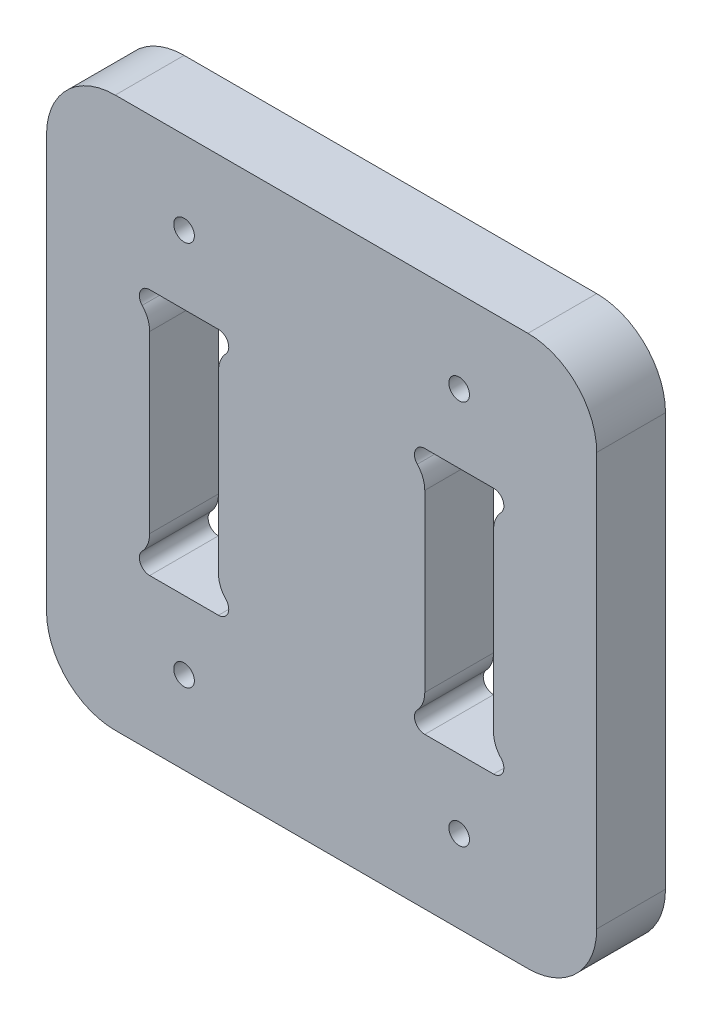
ISO-10303-21;
HEADER;
FILE_DESCRIPTION(('STEP AP214'),'2;1');
FILE_NAME('part.step','',(''),(''),'','','');
FILE_SCHEMA(('AUTOMOTIVE_DESIGN { 1 0 10303 214 1 1 1 1 }'));
ENDSEC;
DATA;
#1=APPLICATION_CONTEXT('core data for automotive mechanical design processes');
#2=APPLICATION_PROTOCOL_DEFINITION('international standard','automotive_design',2000,#1);
#3=PRODUCT_CONTEXT('',#1,'mechanical');
#4=PRODUCT('Part','Part','',(#3));
#5=PRODUCT_RELATED_PRODUCT_CATEGORY('part','',(#4));
#6=PRODUCT_DEFINITION_FORMATION('','',#4);
#7=PRODUCT_DEFINITION_CONTEXT('part definition',#1,'design');
#8=PRODUCT_DEFINITION('design','',#6,#7);
#9=PRODUCT_DEFINITION_SHAPE('','',#8);
#10=(LENGTH_UNIT() NAMED_UNIT(*) SI_UNIT(.MILLI.,.METRE.));
#11=(NAMED_UNIT(*) PLANE_ANGLE_UNIT() SI_UNIT($,.RADIAN.));
#12=(NAMED_UNIT(*) SI_UNIT($,.STERADIAN.) SOLID_ANGLE_UNIT());
#13=UNCERTAINTY_MEASURE_WITH_UNIT(LENGTH_MEASURE(1.E-05),#10,'distance_accuracy_value','');
#14=(GEOMETRIC_REPRESENTATION_CONTEXT(3) GLOBAL_UNCERTAINTY_ASSIGNED_CONTEXT((#13)) GLOBAL_UNIT_ASSIGNED_CONTEXT((#10,
#11,#12)) REPRESENTATION_CONTEXT('',''));
#15=CARTESIAN_POINT('',(0.,0.,0.));
#16=DIRECTION('',(0.,0.,1.));
#17=DIRECTION('',(1.,0.,0.));
#18=AXIS2_PLACEMENT_3D('',#15,#16,#17);
#19=CARTESIAN_POINT('',(30.,-30.,10.));
#20=DIRECTION('',(0.,0.,1.));
#21=DIRECTION('',(1.,0.,0.));
#22=AXIS2_PLACEMENT_3D('',#19,#20,#21);
#23=PLANE('',#22);
#24=CARTESIAN_POINT('',(-20.,28.,10.));
#25=DIRECTION('',(0.,0.,1.));
#26=DIRECTION('',(1.,0.,0.));
#27=AXIS2_PLACEMENT_3D('',#24,#25,#26);
#28=CIRCLE('',#27,1.5);
#29=CARTESIAN_POINT('',(-18.5,28.,10.));
#30=VERTEX_POINT('',#29);
#31=EDGE_CURVE('E315',#30,#30,#28,.T.);
#32=ORIENTED_EDGE('',*,*,#31,.F.);
#33=EDGE_LOOP('',(#32));
#34=FACE_BOUND('',#33,.T.);
#35=CARTESIAN_POINT('',(20.,-28.,10.));
#36=DIRECTION('',(0.,0.,1.));
#37=DIRECTION('',(-1.,0.,0.));
#38=AXIS2_PLACEMENT_3D('',#35,#36,#37);
#39=CIRCLE('',#38,1.5);
#40=CARTESIAN_POINT('',(18.5,-28.,10.));
#41=VERTEX_POINT('',#40);
#42=EDGE_CURVE('E518',#41,#41,#39,.T.);
#43=ORIENTED_EDGE('',*,*,#42,.F.);
#44=EDGE_LOOP('',(#43));
#45=FACE_BOUND('',#44,.T.);
#46=CARTESIAN_POINT('',(30.,-30.,10.));
#47=DIRECTION('',(0.,0.,1.));
#48=DIRECTION('',(1.,0.,0.));
#49=AXIS2_PLACEMENT_3D('',#46,#47,#48);
#50=CIRCLE('',#49,10.);
#51=CARTESIAN_POINT('',(30.,-40.,10.));
#52=VERTEX_POINT('',#51);
#53=CARTESIAN_POINT('',(40.,-30.,10.));
#54=VERTEX_POINT('',#53);
#55=EDGE_CURVE('E526',#52,#54,#50,.T.);
#56=ORIENTED_EDGE('',*,*,#55,.T.);
#57=DIRECTION('',(0.,1.,0.));
#58=VECTOR('',#57,1.);
#59=CARTESIAN_POINT('',(40.,30.,10.));
#60=LINE('',#59,#58);
#61=CARTESIAN_POINT('',(40.,30.,10.));
#62=VERTEX_POINT('',#61);
#63=EDGE_CURVE('E530',#54,#62,#60,.T.);
#64=ORIENTED_EDGE('',*,*,#63,.T.);
#65=CARTESIAN_POINT('',(30.,30.,10.));
#66=DIRECTION('',(0.,0.,1.));
#67=DIRECTION('',(-1.,0.,0.));
#68=AXIS2_PLACEMENT_3D('',#65,#66,#67);
#69=CIRCLE('',#68,10.);
#70=CARTESIAN_POINT('',(30.,40.,10.));
#71=VERTEX_POINT('',#70);
#72=EDGE_CURVE('E534',#62,#71,#69,.T.);
#73=ORIENTED_EDGE('',*,*,#72,.T.);
#74=DIRECTION('',(-1.,0.,0.));
#75=VECTOR('',#74,1.);
#76=CARTESIAN_POINT('',(-30.,40.,10.));
#77=LINE('',#76,#75);
#78=CARTESIAN_POINT('',(-30.,40.,10.));
#79=VERTEX_POINT('',#78);
#80=EDGE_CURVE('E537',#71,#79,#77,.T.);
#81=ORIENTED_EDGE('',*,*,#80,.T.);
#82=CARTESIAN_POINT('',(-30.,30.,10.));
#83=DIRECTION('',(0.,0.,1.));
#84=DIRECTION('',(1.,0.,0.));
#85=AXIS2_PLACEMENT_3D('',#82,#83,#84);
#86=CIRCLE('',#85,10.);
#87=CARTESIAN_POINT('',(-40.,30.,10.));
#88=VERTEX_POINT('',#87);
#89=EDGE_CURVE('E540',#79,#88,#86,.T.);
#90=ORIENTED_EDGE('',*,*,#89,.T.);
#91=DIRECTION('',(0.,-1.,0.));
#92=VECTOR('',#91,1.);
#93=CARTESIAN_POINT('',(-40.,30.,10.));
#94=LINE('',#93,#92);
#95=CARTESIAN_POINT('',(-40.,-30.,10.));
#96=VERTEX_POINT('',#95);
#97=EDGE_CURVE('E543',#88,#96,#94,.T.);
#98=ORIENTED_EDGE('',*,*,#97,.T.);
#99=CARTESIAN_POINT('',(-30.,-30.,10.));
#100=DIRECTION('',(0.,0.,1.));
#101=DIRECTION('',(1.,0.,0.));
#102=AXIS2_PLACEMENT_3D('',#99,#100,#101);
#103=CIRCLE('',#102,10.);
#104=CARTESIAN_POINT('',(-30.,-40.,10.));
#105=VERTEX_POINT('',#104);
#106=EDGE_CURVE('E546',#96,#105,#103,.T.);
#107=ORIENTED_EDGE('',*,*,#106,.T.);
#108=DIRECTION('',(1.,0.,0.));
#109=VECTOR('',#108,1.);
#110=CARTESIAN_POINT('',(-30.,-40.,10.));
#111=LINE('',#110,#109);
#112=EDGE_CURVE('E549',#105,#52,#111,.T.);
#113=ORIENTED_EDGE('',*,*,#112,.T.);
#114=EDGE_LOOP('',(#56,#64,#73,#81,#90,#98,#107,#113));
#115=FACE_BOUND('',#114,.T.);
#116=CARTESIAN_POINT('',(20.,28.,10.));
#117=DIRECTION('',(0.,0.,1.));
#118=DIRECTION('',(-1.,0.,0.));
#119=AXIS2_PLACEMENT_3D('',#116,#117,#118);
#120=CIRCLE('',#119,1.5);
#121=CARTESIAN_POINT('',(18.5,28.,10.));
#122=VERTEX_POINT('',#121);
#123=EDGE_CURVE('E510',#122,#122,#120,.T.);
#124=ORIENTED_EDGE('',*,*,#123,.F.);
#125=EDGE_LOOP('',(#124));
#126=FACE_BOUND('',#125,.T.);
#127=CARTESIAN_POINT('',(11.,12.7250827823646,10.));
#128=DIRECTION('',(0.,0.,-1.));
#129=DIRECTION('',(-1.,0.,0.));
#130=AXIS2_PLACEMENT_3D('',#127,#128,#129);
#131=CIRCLE('',#130,4.);
#132=CARTESIAN_POINT('',(13.9090909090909,15.4704771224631,10.));
#133=VERTEX_POINT('',#132);
#134=CARTESIAN_POINT('',(15.,12.7250827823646,10.));
#135=VERTEX_POINT('',#134);
#136=EDGE_CURVE('E390',#133,#135,#131,.T.);
#137=ORIENTED_EDGE('',*,*,#136,.F.);
#138=CARTESIAN_POINT('',(15.,16.5,10.));
#139=DIRECTION('',(0.,0.,1.));
#140=DIRECTION('',(-1.,0.,0.));
#141=AXIS2_PLACEMENT_3D('',#138,#139,#140);
#142=CIRCLE('',#141,1.5);
#143=CARTESIAN_POINT('',(15.,18.,10.));
#144=VERTEX_POINT('',#143);
#145=EDGE_CURVE('E387',#144,#133,#142,.T.);
#146=ORIENTED_EDGE('',*,*,#145,.F.);
#147=DIRECTION('',(-1.,0.,0.));
#148=VECTOR('',#147,1.);
#149=CARTESIAN_POINT('',(25.,18.,10.));
#150=LINE('',#149,#148);
#151=CARTESIAN_POINT('',(25.,18.,10.));
#152=VERTEX_POINT('',#151);
#153=EDGE_CURVE('E422',#152,#144,#150,.T.);
#154=ORIENTED_EDGE('',*,*,#153,.F.);
#155=CARTESIAN_POINT('',(25.,16.5,10.));
#156=DIRECTION('',(0.,0.,1.));
#157=DIRECTION('',(-1.,0.,0.));
#158=AXIS2_PLACEMENT_3D('',#155,#156,#157);
#159=CIRCLE('',#158,1.5);
#160=CARTESIAN_POINT('',(26.0909090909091,15.4704771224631,10.));
#161=VERTEX_POINT('',#160);
#162=EDGE_CURVE('E418',#161,#152,#159,.T.);
#163=ORIENTED_EDGE('',*,*,#162,.F.);
#164=CARTESIAN_POINT('',(29.,12.7250827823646,10.));
#165=DIRECTION('',(0.,0.,-1.));
#166=DIRECTION('',(-1.,0.,0.));
#167=AXIS2_PLACEMENT_3D('',#164,#165,#166);
#168=CIRCLE('',#167,4.);
#169=CARTESIAN_POINT('',(25.,12.7250827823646,10.));
#170=VERTEX_POINT('',#169);
#171=EDGE_CURVE('E415',#170,#161,#168,.T.);
#172=ORIENTED_EDGE('',*,*,#171,.F.);
#173=DIRECTION('',(0.,1.,0.));
#174=VECTOR('',#173,1.);
#175=CARTESIAN_POINT('',(25.,-12.7250827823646,10.));
#176=LINE('',#175,#174);
#177=CARTESIAN_POINT('',(25.,-12.7250827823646,10.));
#178=VERTEX_POINT('',#177);
#179=EDGE_CURVE('E412',#178,#170,#176,.T.);
#180=ORIENTED_EDGE('',*,*,#179,.F.);
#181=CARTESIAN_POINT('',(29.,-12.7250827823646,10.));
#182=DIRECTION('',(0.,0.,-1.));
#183=DIRECTION('',(-1.,0.,0.));
#184=AXIS2_PLACEMENT_3D('',#181,#182,#183);
#185=CIRCLE('',#184,4.);
#186=CARTESIAN_POINT('',(26.0909090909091,-15.4704771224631,10.));
#187=VERTEX_POINT('',#186);
#188=EDGE_CURVE('E409',#187,#178,#185,.T.);
#189=ORIENTED_EDGE('',*,*,#188,.F.);
#190=CARTESIAN_POINT('',(25.,-16.5,10.));
#191=DIRECTION('',(0.,0.,1.));
#192=DIRECTION('',(-1.,0.,0.));
#193=AXIS2_PLACEMENT_3D('',#190,#191,#192);
#194=CIRCLE('',#193,1.5);
#195=CARTESIAN_POINT('',(25.,-18.,10.));
#196=VERTEX_POINT('',#195);
#197=EDGE_CURVE('E406',#196,#187,#194,.T.);
#198=ORIENTED_EDGE('',*,*,#197,.F.);
#199=DIRECTION('',(1.,0.,0.));
#200=VECTOR('',#199,1.);
#201=CARTESIAN_POINT('',(15.,-18.,10.));
#202=LINE('',#201,#200);
#203=CARTESIAN_POINT('',(15.,-18.,10.));
#204=VERTEX_POINT('',#203);
#205=EDGE_CURVE('E403',#204,#196,#202,.T.);
#206=ORIENTED_EDGE('',*,*,#205,.F.);
#207=CARTESIAN_POINT('',(15.,-16.5,10.));
#208=DIRECTION('',(0.,0.,1.));
#209=DIRECTION('',(-1.,0.,0.));
#210=AXIS2_PLACEMENT_3D('',#207,#208,#209);
#211=CIRCLE('',#210,1.5);
#212=CARTESIAN_POINT('',(13.9090909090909,-15.4704771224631,10.));
#213=VERTEX_POINT('',#212);
#214=EDGE_CURVE('E400',#213,#204,#211,.T.);
#215=ORIENTED_EDGE('',*,*,#214,.F.);
#216=CARTESIAN_POINT('',(11.,-12.7250827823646,10.));
#217=DIRECTION('',(0.,0.,-1.));
#218=DIRECTION('',(-1.,0.,0.));
#219=AXIS2_PLACEMENT_3D('',#216,#217,#218);
#220=CIRCLE('',#219,4.);
#221=CARTESIAN_POINT('',(15.,-12.7250827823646,10.));
#222=VERTEX_POINT('',#221);
#223=EDGE_CURVE('E397',#222,#213,#220,.T.);
#224=ORIENTED_EDGE('',*,*,#223,.F.);
#225=DIRECTION('',(0.,-1.,0.));
#226=VECTOR('',#225,1.);
#227=CARTESIAN_POINT('',(15.,12.7250827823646,10.));
#228=LINE('',#227,#226);
#229=EDGE_CURVE('E394',#135,#222,#228,.T.);
#230=ORIENTED_EDGE('',*,*,#229,.F.);
#231=EDGE_LOOP('',(#137,#146,#154,#163,#172,#180,#189,#198,#206,#215,#224,#230));
#232=FACE_BOUND('',#231,.T.);
#233=DIRECTION('',(0.,1.,0.));
#234=VECTOR('',#233,1.);
#235=CARTESIAN_POINT('',(-15.,12.7250827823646,10.));
#236=LINE('',#235,#234);
#237=CARTESIAN_POINT('',(-15.,-12.7250827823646,10.));
#238=VERTEX_POINT('',#237);
#239=CARTESIAN_POINT('',(-15.,12.7250827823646,10.));
#240=VERTEX_POINT('',#239);
#241=EDGE_CURVE('E264',#238,#240,#236,.T.);
#242=ORIENTED_EDGE('',*,*,#241,.F.);
#243=CARTESIAN_POINT('',(-11.,-12.7250827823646,10.));
#244=DIRECTION('',(0.,0.,-1.));
#245=DIRECTION('',(1.,0.,0.));
#246=AXIS2_PLACEMENT_3D('',#243,#244,#245);
#247=CIRCLE('',#246,4.);
#248=CARTESIAN_POINT('',(-13.9090909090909,-15.4704771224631,10.));
#249=VERTEX_POINT('',#248);
#250=EDGE_CURVE('E255',#249,#238,#247,.T.);
#251=ORIENTED_EDGE('',*,*,#250,.F.);
#252=CARTESIAN_POINT('',(-15.,-16.5,10.));
#253=DIRECTION('',(0.,0.,1.));
#254=DIRECTION('',(1.,0.,0.));
#255=AXIS2_PLACEMENT_3D('',#252,#253,#254);
#256=CIRCLE('',#255,1.5);
#257=CARTESIAN_POINT('',(-15.,-18.,10.));
#258=VERTEX_POINT('',#257);
#259=EDGE_CURVE('E310',#258,#249,#256,.T.);
#260=ORIENTED_EDGE('',*,*,#259,.F.);
#261=DIRECTION('',(1.,0.,0.));
#262=VECTOR('',#261,1.);
#263=CARTESIAN_POINT('',(-15.,-18.,10.));
#264=LINE('',#263,#262);
#265=CARTESIAN_POINT('',(-25.,-18.,10.));
#266=VERTEX_POINT('',#265);
#267=EDGE_CURVE('E307',#266,#258,#264,.T.);
#268=ORIENTED_EDGE('',*,*,#267,.F.);
#269=CARTESIAN_POINT('',(-25.,-16.5,10.));
#270=DIRECTION('',(0.,0.,1.));
#271=DIRECTION('',(1.,0.,0.));
#272=AXIS2_PLACEMENT_3D('',#269,#270,#271);
#273=CIRCLE('',#272,1.5);
#274=CARTESIAN_POINT('',(-26.0909090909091,-15.4704771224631,10.));
#275=VERTEX_POINT('',#274);
#276=EDGE_CURVE('E304',#275,#266,#273,.T.);
#277=ORIENTED_EDGE('',*,*,#276,.F.);
#278=CARTESIAN_POINT('',(-29.,-12.7250827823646,10.));
#279=DIRECTION('',(0.,0.,-1.));
#280=DIRECTION('',(1.,0.,0.));
#281=AXIS2_PLACEMENT_3D('',#278,#279,#280);
#282=CIRCLE('',#281,4.);
#283=CARTESIAN_POINT('',(-25.,-12.7250827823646,10.));
#284=VERTEX_POINT('',#283);
#285=EDGE_CURVE('E301',#284,#275,#282,.T.);
#286=ORIENTED_EDGE('',*,*,#285,.F.);
#287=DIRECTION('',(0.,-1.,0.));
#288=VECTOR('',#287,1.);
#289=CARTESIAN_POINT('',(-25.,-12.7250827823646,10.));
#290=LINE('',#289,#288);
#291=CARTESIAN_POINT('',(-25.,12.7250827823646,10.));
#292=VERTEX_POINT('',#291);
#293=EDGE_CURVE('E298',#292,#284,#290,.T.);
#294=ORIENTED_EDGE('',*,*,#293,.F.);
#295=CARTESIAN_POINT('',(-29.,12.7250827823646,10.));
#296=DIRECTION('',(0.,0.,-1.));
#297=DIRECTION('',(1.,0.,0.));
#298=AXIS2_PLACEMENT_3D('',#295,#296,#297);
#299=CIRCLE('',#298,4.);
#300=CARTESIAN_POINT('',(-26.0909090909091,15.4704771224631,10.));
#301=VERTEX_POINT('',#300);
#302=EDGE_CURVE('E295',#301,#292,#299,.T.);
#303=ORIENTED_EDGE('',*,*,#302,.F.);
#304=CARTESIAN_POINT('',(-25.,16.5,10.));
#305=DIRECTION('',(0.,0.,1.));
#306=DIRECTION('',(1.,0.,0.));
#307=AXIS2_PLACEMENT_3D('',#304,#305,#306);
#308=CIRCLE('',#307,1.5);
#309=CARTESIAN_POINT('',(-25.,18.,10.));
#310=VERTEX_POINT('',#309);
#311=EDGE_CURVE('E292',#310,#301,#308,.T.);
#312=ORIENTED_EDGE('',*,*,#311,.F.);
#313=DIRECTION('',(-1.,0.,0.));
#314=VECTOR('',#313,1.);
#315=CARTESIAN_POINT('',(-25.,18.,10.));
#316=LINE('',#315,#314);
#317=CARTESIAN_POINT('',(-15.,18.,10.));
#318=VERTEX_POINT('',#317);
#319=EDGE_CURVE('E289',#318,#310,#316,.T.);
#320=ORIENTED_EDGE('',*,*,#319,.F.);
#321=CARTESIAN_POINT('',(-15.,16.5,10.));
#322=DIRECTION('',(0.,0.,1.));
#323=DIRECTION('',(1.,0.,0.));
#324=AXIS2_PLACEMENT_3D('',#321,#322,#323);
#325=CIRCLE('',#324,1.5);
#326=CARTESIAN_POINT('',(-13.9090909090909,15.4704771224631,10.));
#327=VERTEX_POINT('',#326);
#328=EDGE_CURVE('E283',#327,#318,#325,.T.);
#329=ORIENTED_EDGE('',*,*,#328,.F.);
#330=CARTESIAN_POINT('',(-11.,12.7250827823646,10.));
#331=DIRECTION('',(0.,0.,-1.));
#332=DIRECTION('',(1.,0.,0.));
#333=AXIS2_PLACEMENT_3D('',#330,#331,#332);
#334=CIRCLE('',#333,4.);
#335=EDGE_CURVE('E279',#240,#327,#334,.T.);
#336=ORIENTED_EDGE('',*,*,#335,.F.);
#337=EDGE_LOOP('',(#242,#251,#260,#268,#277,#286,#294,#303,#312,#320,#329,#336));
#338=FACE_BOUND('',#337,.T.);
#339=CARTESIAN_POINT('',(-20.,-28.,10.));
#340=DIRECTION('',(0.,0.,1.));
#341=DIRECTION('',(1.,0.,0.));
#342=AXIS2_PLACEMENT_3D('',#339,#340,#341);
#343=CIRCLE('',#342,1.5);
#344=CARTESIAN_POINT('',(-18.5,-28.,10.));
#345=VERTEX_POINT('',#344);
#346=EDGE_CURVE('E691',#345,#345,#343,.T.);
#347=ORIENTED_EDGE('',*,*,#346,.F.);
#348=EDGE_LOOP('',(#347));
#349=FACE_BOUND('',#348,.T.);
#350=ADVANCED_FACE('F45',(#34,#45,#115,#126,#232,#338,#349),#23,.T.);
#351=CARTESIAN_POINT('',(30.,-30.,0.));
#352=DIRECTION('',(0.,0.,1.));
#353=DIRECTION('',(1.,0.,0.));
#354=AXIS2_PLACEMENT_3D('',#351,#352,#353);
#355=PLANE('',#354);
#356=CARTESIAN_POINT('',(15.,16.5,0.));
#357=DIRECTION('',(0.,0.,1.));
#358=DIRECTION('',(-1.,0.,0.));
#359=AXIS2_PLACEMENT_3D('',#356,#357,#358);
#360=CIRCLE('',#359,1.5);
#361=CARTESIAN_POINT('',(15.,18.,0.));
#362=VERTEX_POINT('',#361);
#363=CARTESIAN_POINT('',(13.9090909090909,15.4704771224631,0.));
#364=VERTEX_POINT('',#363);
#365=EDGE_CURVE('E273',#362,#364,#360,.T.);
#366=ORIENTED_EDGE('',*,*,#365,.T.);
#367=CARTESIAN_POINT('',(11.,12.7250827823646,0.));
#368=DIRECTION('',(0.,0.,-1.));
#369=DIRECTION('',(-1.,0.,0.));
#370=AXIS2_PLACEMENT_3D('',#367,#368,#369);
#371=CIRCLE('',#370,4.);
#372=CARTESIAN_POINT('',(15.,12.7250827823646,0.));
#373=VERTEX_POINT('',#372);
#374=EDGE_CURVE('E429',#364,#373,#371,.T.);
#375=ORIENTED_EDGE('',*,*,#374,.T.);
#376=DIRECTION('',(0.,-1.,0.));
#377=VECTOR('',#376,1.);
#378=CARTESIAN_POINT('',(15.,12.7250827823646,0.));
#379=LINE('',#378,#377);
#380=CARTESIAN_POINT('',(15.,-12.7250827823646,0.));
#381=VERTEX_POINT('',#380);
#382=EDGE_CURVE('E433',#373,#381,#379,.T.);
#383=ORIENTED_EDGE('',*,*,#382,.T.);
#384=CARTESIAN_POINT('',(11.,-12.7250827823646,0.));
#385=DIRECTION('',(0.,0.,-1.));
#386=DIRECTION('',(-1.,0.,0.));
#387=AXIS2_PLACEMENT_3D('',#384,#385,#386);
#388=CIRCLE('',#387,4.);
#389=CARTESIAN_POINT('',(13.9090909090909,-15.4704771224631,0.));
#390=VERTEX_POINT('',#389);
#391=EDGE_CURVE('E437',#381,#390,#388,.T.);
#392=ORIENTED_EDGE('',*,*,#391,.T.);
#393=CARTESIAN_POINT('',(15.,-16.5,0.));
#394=DIRECTION('',(0.,0.,1.));
#395=DIRECTION('',(-1.,0.,0.));
#396=AXIS2_PLACEMENT_3D('',#393,#394,#395);
#397=CIRCLE('',#396,1.5);
#398=CARTESIAN_POINT('',(15.,-18.,0.));
#399=VERTEX_POINT('',#398);
#400=EDGE_CURVE('E441',#390,#399,#397,.T.);
#401=ORIENTED_EDGE('',*,*,#400,.T.);
#402=DIRECTION('',(1.,0.,0.));
#403=VECTOR('',#402,1.);
#404=CARTESIAN_POINT('',(15.,-18.,0.));
#405=LINE('',#404,#403);
#406=CARTESIAN_POINT('',(25.,-18.,0.));
#407=VERTEX_POINT('',#406);
#408=EDGE_CURVE('E445',#399,#407,#405,.T.);
#409=ORIENTED_EDGE('',*,*,#408,.T.);
#410=CARTESIAN_POINT('',(25.,-16.5,0.));
#411=DIRECTION('',(0.,0.,1.));
#412=DIRECTION('',(-1.,0.,0.));
#413=AXIS2_PLACEMENT_3D('',#410,#411,#412);
#414=CIRCLE('',#413,1.5);
#415=CARTESIAN_POINT('',(26.0909090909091,-15.4704771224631,0.));
#416=VERTEX_POINT('',#415);
#417=EDGE_CURVE('E449',#407,#416,#414,.T.);
#418=ORIENTED_EDGE('',*,*,#417,.T.);
#419=CARTESIAN_POINT('',(29.,-12.7250827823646,0.));
#420=DIRECTION('',(0.,0.,-1.));
#421=DIRECTION('',(-1.,0.,0.));
#422=AXIS2_PLACEMENT_3D('',#419,#420,#421);
#423=CIRCLE('',#422,4.);
#424=CARTESIAN_POINT('',(25.,-12.7250827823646,0.));
#425=VERTEX_POINT('',#424);
#426=EDGE_CURVE('E453',#416,#425,#423,.T.);
#427=ORIENTED_EDGE('',*,*,#426,.T.);
#428=DIRECTION('',(0.,1.,0.));
#429=VECTOR('',#428,1.);
#430=CARTESIAN_POINT('',(25.,-12.7250827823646,0.));
#431=LINE('',#430,#429);
#432=CARTESIAN_POINT('',(25.,12.7250827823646,0.));
#433=VERTEX_POINT('',#432);
#434=EDGE_CURVE('E457',#425,#433,#431,.T.);
#435=ORIENTED_EDGE('',*,*,#434,.T.);
#436=CARTESIAN_POINT('',(29.,12.7250827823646,0.));
#437=DIRECTION('',(0.,0.,-1.));
#438=DIRECTION('',(-1.,0.,0.));
#439=AXIS2_PLACEMENT_3D('',#436,#437,#438);
#440=CIRCLE('',#439,4.);
#441=CARTESIAN_POINT('',(26.0909090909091,15.4704771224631,0.));
#442=VERTEX_POINT('',#441);
#443=EDGE_CURVE('E461',#433,#442,#440,.T.);
#444=ORIENTED_EDGE('',*,*,#443,.T.);
#445=CARTESIAN_POINT('',(25.,16.5,0.));
#446=DIRECTION('',(0.,0.,1.));
#447=DIRECTION('',(-1.,0.,0.));
#448=AXIS2_PLACEMENT_3D('',#445,#446,#447);
#449=CIRCLE('',#448,1.5);
#450=CARTESIAN_POINT('',(25.,18.,0.));
#451=VERTEX_POINT('',#450);
#452=EDGE_CURVE('E465',#442,#451,#449,.T.);
#453=ORIENTED_EDGE('',*,*,#452,.T.);
#454=DIRECTION('',(-1.,0.,0.));
#455=VECTOR('',#454,1.);
#456=CARTESIAN_POINT('',(25.,18.,0.));
#457=LINE('',#456,#455);
#458=EDGE_CURVE('E391',#451,#362,#457,.T.);
#459=ORIENTED_EDGE('',*,*,#458,.T.);
#460=EDGE_LOOP('',(#366,#375,#383,#392,#401,#409,#418,#427,#435,#444,#453,#459));
#461=FACE_BOUND('',#460,.T.);
#462=CARTESIAN_POINT('',(30.,-30.,0.));
#463=DIRECTION('',(0.,0.,1.));
#464=DIRECTION('',(1.,0.,0.));
#465=AXIS2_PLACEMENT_3D('',#462,#463,#464);
#466=CIRCLE('',#465,10.);
#467=CARTESIAN_POINT('',(30.,-40.,0.));
#468=VERTEX_POINT('',#467);
#469=CARTESIAN_POINT('',(40.,-30.,0.));
#470=VERTEX_POINT('',#469);
#471=EDGE_CURVE('E522',#468,#470,#466,.T.);
#472=ORIENTED_EDGE('',*,*,#471,.F.);
#473=DIRECTION('',(1.,0.,0.));
#474=VECTOR('',#473,1.);
#475=CARTESIAN_POINT('',(-30.,-40.,0.));
#476=LINE('',#475,#474);
#477=CARTESIAN_POINT('',(-30.,-40.,0.));
#478=VERTEX_POINT('',#477);
#479=EDGE_CURVE('E531',#478,#468,#476,.T.);
#480=ORIENTED_EDGE('',*,*,#479,.F.);
#481=CARTESIAN_POINT('',(-30.,-30.,0.));
#482=DIRECTION('',(0.,0.,1.));
#483=DIRECTION('',(1.,0.,0.));
#484=AXIS2_PLACEMENT_3D('',#481,#482,#483);
#485=CIRCLE('',#484,10.);
#486=CARTESIAN_POINT('',(-40.,-30.,0.));
#487=VERTEX_POINT('',#486);
#488=EDGE_CURVE('E571',#487,#478,#485,.T.);
#489=ORIENTED_EDGE('',*,*,#488,.F.);
#490=DIRECTION('',(0.,-1.,0.));
#491=VECTOR('',#490,1.);
#492=CARTESIAN_POINT('',(-40.,30.,0.));
#493=LINE('',#492,#491);
#494=CARTESIAN_POINT('',(-40.,30.,0.));
#495=VERTEX_POINT('',#494);
#496=EDGE_CURVE('E568',#495,#487,#493,.T.);
#497=ORIENTED_EDGE('',*,*,#496,.F.);
#498=CARTESIAN_POINT('',(-30.,30.,0.));
#499=DIRECTION('',(0.,0.,1.));
#500=DIRECTION('',(1.,0.,0.));
#501=AXIS2_PLACEMENT_3D('',#498,#499,#500);
#502=CIRCLE('',#501,10.);
#503=CARTESIAN_POINT('',(-30.,40.,0.));
#504=VERTEX_POINT('',#503);
#505=EDGE_CURVE('E565',#504,#495,#502,.T.);
#506=ORIENTED_EDGE('',*,*,#505,.F.);
#507=DIRECTION('',(-1.,0.,0.));
#508=VECTOR('',#507,1.);
#509=CARTESIAN_POINT('',(-30.,40.,0.));
#510=LINE('',#509,#508);
#511=CARTESIAN_POINT('',(30.,40.,0.));
#512=VERTEX_POINT('',#511);
#513=EDGE_CURVE('E562',#512,#504,#510,.T.);
#514=ORIENTED_EDGE('',*,*,#513,.F.);
#515=CARTESIAN_POINT('',(30.,30.,0.));
#516=DIRECTION('',(0.,0.,1.));
#517=DIRECTION('',(-1.,0.,0.));
#518=AXIS2_PLACEMENT_3D('',#515,#516,#517);
#519=CIRCLE('',#518,10.);
#520=CARTESIAN_POINT('',(40.,30.,0.));
#521=VERTEX_POINT('',#520);
#522=EDGE_CURVE('E559',#521,#512,#519,.T.);
#523=ORIENTED_EDGE('',*,*,#522,.F.);
#524=DIRECTION('',(0.,1.,0.));
#525=VECTOR('',#524,1.);
#526=CARTESIAN_POINT('',(40.,30.,0.));
#527=LINE('',#526,#525);
#528=EDGE_CURVE('E556',#470,#521,#527,.T.);
#529=ORIENTED_EDGE('',*,*,#528,.F.);
#530=EDGE_LOOP('',(#472,#480,#489,#497,#506,#514,#523,#529));
#531=FACE_BOUND('',#530,.T.);
#532=CARTESIAN_POINT('',(20.,-28.,0.));
#533=DIRECTION('',(0.,0.,1.));
#534=DIRECTION('',(-1.,0.,0.));
#535=AXIS2_PLACEMENT_3D('',#532,#533,#534);
#536=CIRCLE('',#535,1.5);
#537=CARTESIAN_POINT('',(18.5,-28.,0.));
#538=VERTEX_POINT('',#537);
#539=EDGE_CURVE('E514',#538,#538,#536,.T.);
#540=ORIENTED_EDGE('',*,*,#539,.T.);
#541=EDGE_LOOP('',(#540));
#542=FACE_BOUND('',#541,.T.);
#543=CARTESIAN_POINT('',(20.,28.,0.));
#544=DIRECTION('',(0.,0.,1.));
#545=DIRECTION('',(-1.,0.,0.));
#546=AXIS2_PLACEMENT_3D('',#543,#544,#545);
#547=CIRCLE('',#546,1.5);
#548=CARTESIAN_POINT('',(18.5,28.,0.));
#549=VERTEX_POINT('',#548);
#550=EDGE_CURVE('E509',#549,#549,#547,.T.);
#551=ORIENTED_EDGE('',*,*,#550,.T.);
#552=EDGE_LOOP('',(#551));
#553=FACE_BOUND('',#552,.T.);
#554=CARTESIAN_POINT('',(-11.,-12.7250827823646,0.));
#555=DIRECTION('',(0.,0.,-1.));
#556=DIRECTION('',(1.,0.,0.));
#557=AXIS2_PLACEMENT_3D('',#554,#555,#556);
#558=CIRCLE('',#557,4.);
#559=CARTESIAN_POINT('',(-13.9090909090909,-15.4704771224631,0.));
#560=VERTEX_POINT('',#559);
#561=CARTESIAN_POINT('',(-15.,-12.7250827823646,0.));
#562=VERTEX_POINT('',#561);
#563=EDGE_CURVE('E69',#560,#562,#558,.T.);
#564=ORIENTED_EDGE('',*,*,#563,.T.);
#565=DIRECTION('',(0.,1.,0.));
#566=VECTOR('',#565,1.);
#567=CARTESIAN_POINT('',(-15.,12.7250827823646,0.));
#568=LINE('',#567,#566);
#569=CARTESIAN_POINT('',(-15.,12.7250827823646,0.));
#570=VERTEX_POINT('',#569);
#571=EDGE_CURVE('E271',#562,#570,#568,.T.);
#572=ORIENTED_EDGE('',*,*,#571,.T.);
#573=CARTESIAN_POINT('',(-11.,12.7250827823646,0.));
#574=DIRECTION('',(0.,0.,-1.));
#575=DIRECTION('',(1.,0.,0.));
#576=AXIS2_PLACEMENT_3D('',#573,#574,#575);
#577=CIRCLE('',#576,4.);
#578=CARTESIAN_POINT('',(-13.9090909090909,15.4704771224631,0.));
#579=VERTEX_POINT('',#578);
#580=EDGE_CURVE('E318',#570,#579,#577,.T.);
#581=ORIENTED_EDGE('',*,*,#580,.T.);
#582=CARTESIAN_POINT('',(-15.,16.5,0.));
#583=DIRECTION('',(0.,0.,1.));
#584=DIRECTION('',(1.,0.,0.));
#585=AXIS2_PLACEMENT_3D('',#582,#583,#584);
#586=CIRCLE('',#585,1.5);
#587=CARTESIAN_POINT('',(-15.,18.,0.));
#588=VERTEX_POINT('',#587);
#589=EDGE_CURVE('E322',#579,#588,#586,.T.);
#590=ORIENTED_EDGE('',*,*,#589,.T.);
#591=DIRECTION('',(-1.,0.,0.));
#592=VECTOR('',#591,1.);
#593=CARTESIAN_POINT('',(-25.,18.,0.));
#594=LINE('',#593,#592);
#595=CARTESIAN_POINT('',(-25.,18.,0.));
#596=VERTEX_POINT('',#595);
#597=EDGE_CURVE('E326',#588,#596,#594,.T.);
#598=ORIENTED_EDGE('',*,*,#597,.T.);
#599=CARTESIAN_POINT('',(-25.,16.5,0.));
#600=DIRECTION('',(0.,0.,1.));
#601=DIRECTION('',(1.,0.,0.));
#602=AXIS2_PLACEMENT_3D('',#599,#600,#601);
#603=CIRCLE('',#602,1.5);
#604=CARTESIAN_POINT('',(-26.0909090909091,15.4704771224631,0.));
#605=VERTEX_POINT('',#604);
#606=EDGE_CURVE('E330',#596,#605,#603,.T.);
#607=ORIENTED_EDGE('',*,*,#606,.T.);
#608=CARTESIAN_POINT('',(-29.,12.7250827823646,0.));
#609=DIRECTION('',(0.,0.,-1.));
#610=DIRECTION('',(1.,0.,0.));
#611=AXIS2_PLACEMENT_3D('',#608,#609,#610);
#612=CIRCLE('',#611,4.);
#613=CARTESIAN_POINT('',(-25.,12.7250827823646,0.));
#614=VERTEX_POINT('',#613);
#615=EDGE_CURVE('E334',#605,#614,#612,.T.);
#616=ORIENTED_EDGE('',*,*,#615,.T.);
#617=DIRECTION('',(0.,-1.,0.));
#618=VECTOR('',#617,1.);
#619=CARTESIAN_POINT('',(-25.,-12.7250827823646,0.));
#620=LINE('',#619,#618);
#621=CARTESIAN_POINT('',(-25.,-12.7250827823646,0.));
#622=VERTEX_POINT('',#621);
#623=EDGE_CURVE('E338',#614,#622,#620,.T.);
#624=ORIENTED_EDGE('',*,*,#623,.T.);
#625=CARTESIAN_POINT('',(-29.,-12.7250827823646,0.));
#626=DIRECTION('',(0.,0.,-1.));
#627=DIRECTION('',(1.,0.,0.));
#628=AXIS2_PLACEMENT_3D('',#625,#626,#627);
#629=CIRCLE('',#628,4.);
#630=CARTESIAN_POINT('',(-26.0909090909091,-15.4704771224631,0.));
#631=VERTEX_POINT('',#630);
#632=EDGE_CURVE('E342',#622,#631,#629,.T.);
#633=ORIENTED_EDGE('',*,*,#632,.T.);
#634=CARTESIAN_POINT('',(-25.,-16.5,0.));
#635=DIRECTION('',(0.,0.,1.));
#636=DIRECTION('',(1.,0.,0.));
#637=AXIS2_PLACEMENT_3D('',#634,#635,#636);
#638=CIRCLE('',#637,1.5);
#639=CARTESIAN_POINT('',(-25.,-18.,0.));
#640=VERTEX_POINT('',#639);
#641=EDGE_CURVE('E346',#631,#640,#638,.T.);
#642=ORIENTED_EDGE('',*,*,#641,.T.);
#643=DIRECTION('',(1.,0.,0.));
#644=VECTOR('',#643,1.);
#645=CARTESIAN_POINT('',(-15.,-18.,0.));
#646=LINE('',#645,#644);
#647=CARTESIAN_POINT('',(-15.,-18.,0.));
#648=VERTEX_POINT('',#647);
#649=EDGE_CURVE('E350',#640,#648,#646,.T.);
#650=ORIENTED_EDGE('',*,*,#649,.T.);
#651=CARTESIAN_POINT('',(-15.,-16.5,0.));
#652=DIRECTION('',(0.,0.,1.));
#653=DIRECTION('',(1.,0.,0.));
#654=AXIS2_PLACEMENT_3D('',#651,#652,#653);
#655=CIRCLE('',#654,1.5);
#656=EDGE_CURVE('E265',#648,#560,#655,.T.);
#657=ORIENTED_EDGE('',*,*,#656,.T.);
#658=EDGE_LOOP('',(#564,#572,#581,#590,#598,#607,#616,#624,#633,#642,#650,#657));
#659=FACE_BOUND('',#658,.T.);
#660=CARTESIAN_POINT('',(-20.,28.,0.));
#661=DIRECTION('',(0.,0.,1.));
#662=DIRECTION('',(1.,0.,0.));
#663=AXIS2_PLACEMENT_3D('',#660,#661,#662);
#664=CIRCLE('',#663,1.5);
#665=CARTESIAN_POINT('',(-18.5,28.,0.));
#666=VERTEX_POINT('',#665);
#667=EDGE_CURVE('E685',#666,#666,#664,.T.);
#668=ORIENTED_EDGE('',*,*,#667,.T.);
#669=EDGE_LOOP('',(#668));
#670=FACE_BOUND('',#669,.T.);
#671=CARTESIAN_POINT('',(-20.,-28.,0.));
#672=DIRECTION('',(0.,0.,1.));
#673=DIRECTION('',(1.,0.,0.));
#674=AXIS2_PLACEMENT_3D('',#671,#672,#673);
#675=CIRCLE('',#674,1.5);
#676=CARTESIAN_POINT('',(-18.5,-28.,0.));
#677=VERTEX_POINT('',#676);
#678=EDGE_CURVE('E688',#677,#677,#675,.T.);
#679=ORIENTED_EDGE('',*,*,#678,.T.);
#680=EDGE_LOOP('',(#679));
#681=FACE_BOUND('',#680,.T.);
#682=ADVANCED_FACE('F610',(#461,#531,#542,#553,#659,#670,#681),#355,.F.);
#683=CARTESIAN_POINT('',(30.,-30.,10.));
#684=DIRECTION('',(0.,0.,-1.));
#685=DIRECTION('',(-1.,0.,0.));
#686=AXIS2_PLACEMENT_3D('',#683,#684,#685);
#687=CYLINDRICAL_SURFACE('',#686,10.);
#688=ORIENTED_EDGE('',*,*,#471,.T.);
#689=DIRECTION('',(0.,0.,-1.));
#690=VECTOR('',#689,1.);
#691=CARTESIAN_POINT('',(40.,-30.,10.));
#692=LINE('',#691,#690);
#693=EDGE_CURVE('E11',#54,#470,#692,.T.);
#694=ORIENTED_EDGE('',*,*,#693,.F.);
#695=ORIENTED_EDGE('',*,*,#55,.F.);
#696=DIRECTION('',(0.,0.,-1.));
#697=VECTOR('',#696,1.);
#698=CARTESIAN_POINT('',(30.,-40.,10.));
#699=LINE('',#698,#697);
#700=EDGE_CURVE('E552',#52,#468,#699,.T.);
#701=ORIENTED_EDGE('',*,*,#700,.T.);
#702=EDGE_LOOP('',(#688,#694,#695,#701));
#703=FACE_BOUND('',#702,.T.);
#704=ADVANCED_FACE('F47',(#703),#687,.T.);
#705=CARTESIAN_POINT('',(40.,30.,10.));
#706=DIRECTION('',(-1.,0.,0.));
#707=DIRECTION('',(0.,-1.,0.));
#708=AXIS2_PLACEMENT_3D('',#705,#706,#707);
#709=PLANE('',#708);
#710=ORIENTED_EDGE('',*,*,#528,.T.);
#711=DIRECTION('',(0.,0.,-1.));
#712=VECTOR('',#711,1.);
#713=CARTESIAN_POINT('',(40.,30.,10.));
#714=LINE('',#713,#712);
#715=EDGE_CURVE('E54',#62,#521,#714,.T.);
#716=ORIENTED_EDGE('',*,*,#715,.F.);
#717=ORIENTED_EDGE('',*,*,#63,.F.);
#718=ORIENTED_EDGE('',*,*,#693,.T.);
#719=EDGE_LOOP('',(#710,#716,#717,#718));
#720=FACE_BOUND('',#719,.T.);
#721=ADVANCED_FACE('F628',(#720),#709,.F.);
#722=CARTESIAN_POINT('',(30.,30.,10.));
#723=DIRECTION('',(0.,0.,-1.));
#724=DIRECTION('',(-1.,0.,0.));
#725=AXIS2_PLACEMENT_3D('',#722,#723,#724);
#726=CYLINDRICAL_SURFACE('',#725,10.);
#727=ORIENTED_EDGE('',*,*,#522,.T.);
#728=DIRECTION('',(0.,0.,-1.));
#729=VECTOR('',#728,1.);
#730=CARTESIAN_POINT('',(30.,40.,10.));
#731=LINE('',#730,#729);
#732=EDGE_CURVE('E595',#71,#512,#731,.T.);
#733=ORIENTED_EDGE('',*,*,#732,.F.);
#734=ORIENTED_EDGE('',*,*,#72,.F.);
#735=ORIENTED_EDGE('',*,*,#715,.T.);
#736=EDGE_LOOP('',(#727,#733,#734,#735));
#737=FACE_BOUND('',#736,.T.);
#738=ADVANCED_FACE('F604',(#737),#726,.T.);
#739=CARTESIAN_POINT('',(-30.,40.,10.));
#740=DIRECTION('',(0.,-1.,0.));
#741=DIRECTION('',(0.,0.,-1.));
#742=AXIS2_PLACEMENT_3D('',#739,#740,#741);
#743=PLANE('',#742);
#744=ORIENTED_EDGE('',*,*,#513,.T.);
#745=DIRECTION('',(0.,0.,-1.));
#746=VECTOR('',#745,1.);
#747=CARTESIAN_POINT('',(-30.,40.,10.));
#748=LINE('',#747,#746);
#749=EDGE_CURVE('E591',#79,#504,#748,.T.);
#750=ORIENTED_EDGE('',*,*,#749,.F.);
#751=ORIENTED_EDGE('',*,*,#80,.F.);
#752=ORIENTED_EDGE('',*,*,#732,.T.);
#753=EDGE_LOOP('',(#744,#750,#751,#752));
#754=FACE_BOUND('',#753,.T.);
#755=ADVANCED_FACE('F616',(#754),#743,.F.);
#756=CARTESIAN_POINT('',(-30.,30.,10.));
#757=DIRECTION('',(0.,0.,-1.));
#758=DIRECTION('',(-1.,0.,0.));
#759=AXIS2_PLACEMENT_3D('',#756,#757,#758);
#760=CYLINDRICAL_SURFACE('',#759,10.);
#761=ORIENTED_EDGE('',*,*,#505,.T.);
#762=DIRECTION('',(0.,0.,-1.));
#763=VECTOR('',#762,1.);
#764=CARTESIAN_POINT('',(-40.,30.,10.));
#765=LINE('',#764,#763);
#766=EDGE_CURVE('E587',#88,#495,#765,.T.);
#767=ORIENTED_EDGE('',*,*,#766,.F.);
#768=ORIENTED_EDGE('',*,*,#89,.F.);
#769=ORIENTED_EDGE('',*,*,#749,.T.);
#770=EDGE_LOOP('',(#761,#767,#768,#769));
#771=FACE_BOUND('',#770,.T.);
#772=ADVANCED_FACE('F620',(#771),#760,.T.);
#773=CARTESIAN_POINT('',(-40.,30.,10.));
#774=DIRECTION('',(1.,0.,0.));
#775=DIRECTION('',(0.,1.,0.));
#776=AXIS2_PLACEMENT_3D('',#773,#774,#775);
#777=PLANE('',#776);
#778=ORIENTED_EDGE('',*,*,#496,.T.);
#779=DIRECTION('',(0.,0.,-1.));
#780=VECTOR('',#779,1.);
#781=CARTESIAN_POINT('',(-40.,-30.,10.));
#782=LINE('',#781,#780);
#783=EDGE_CURVE('E583',#96,#487,#782,.T.);
#784=ORIENTED_EDGE('',*,*,#783,.F.);
#785=ORIENTED_EDGE('',*,*,#97,.F.);
#786=ORIENTED_EDGE('',*,*,#766,.T.);
#787=EDGE_LOOP('',(#778,#784,#785,#786));
#788=FACE_BOUND('',#787,.T.);
#789=ADVANCED_FACE('F641',(#788),#777,.F.);
#790=CARTESIAN_POINT('',(-30.,-30.,10.));
#791=DIRECTION('',(0.,0.,-1.));
#792=DIRECTION('',(-1.,0.,0.));
#793=AXIS2_PLACEMENT_3D('',#790,#791,#792);
#794=CYLINDRICAL_SURFACE('',#793,10.);
#795=ORIENTED_EDGE('',*,*,#488,.T.);
#796=DIRECTION('',(0.,0.,-1.));
#797=VECTOR('',#796,1.);
#798=CARTESIAN_POINT('',(-30.,-40.,10.));
#799=LINE('',#798,#797);
#800=EDGE_CURVE('E579',#105,#478,#799,.T.);
#801=ORIENTED_EDGE('',*,*,#800,.F.);
#802=ORIENTED_EDGE('',*,*,#106,.F.);
#803=ORIENTED_EDGE('',*,*,#783,.T.);
#804=EDGE_LOOP('',(#795,#801,#802,#803));
#805=FACE_BOUND('',#804,.T.);
#806=ADVANCED_FACE('F639',(#805),#794,.T.);
#807=CARTESIAN_POINT('',(-30.,-40.,10.));
#808=DIRECTION('',(0.,1.,0.));
#809=DIRECTION('',(0.,0.,1.));
#810=AXIS2_PLACEMENT_3D('',#807,#808,#809);
#811=PLANE('',#810);
#812=ORIENTED_EDGE('',*,*,#479,.T.);
#813=ORIENTED_EDGE('',*,*,#700,.F.);
#814=ORIENTED_EDGE('',*,*,#112,.F.);
#815=ORIENTED_EDGE('',*,*,#800,.T.);
#816=EDGE_LOOP('',(#812,#813,#814,#815));
#817=FACE_BOUND('',#816,.T.);
#818=ADVANCED_FACE('F634',(#817),#811,.F.);
#819=CARTESIAN_POINT('',(20.,-28.,10.));
#820=DIRECTION('',(0.,0.,-1.));
#821=DIRECTION('',(-1.,0.,0.));
#822=AXIS2_PLACEMENT_3D('',#819,#820,#821);
#823=CYLINDRICAL_SURFACE('',#822,1.5);
#824=ORIENTED_EDGE('',*,*,#42,.T.);
#825=EDGE_LOOP('',(#824));
#826=FACE_BOUND('',#825,.T.);
#827=ORIENTED_EDGE('',*,*,#539,.F.);
#828=EDGE_LOOP('',(#827));
#829=FACE_BOUND('',#828,.T.);
#830=ADVANCED_FACE('F661',(#826,#829),#823,.F.);
#831=CARTESIAN_POINT('',(20.,28.,10.));
#832=DIRECTION('',(0.,0.,-1.));
#833=DIRECTION('',(-1.,0.,0.));
#834=AXIS2_PLACEMENT_3D('',#831,#832,#833);
#835=CYLINDRICAL_SURFACE('',#834,1.5);
#836=ORIENTED_EDGE('',*,*,#123,.T.);
#837=EDGE_LOOP('',(#836));
#838=FACE_BOUND('',#837,.T.);
#839=ORIENTED_EDGE('',*,*,#550,.F.);
#840=EDGE_LOOP('',(#839));
#841=FACE_BOUND('',#840,.T.);
#842=ADVANCED_FACE('F668',(#838,#841),#835,.F.);
#843=CARTESIAN_POINT('',(15.,16.5,10.));
#844=DIRECTION('',(0.,0.,-1.));
#845=DIRECTION('',(-1.,0.,0.));
#846=AXIS2_PLACEMENT_3D('',#843,#844,#845);
#847=CYLINDRICAL_SURFACE('',#846,1.5);
#848=ORIENTED_EDGE('',*,*,#365,.F.);
#849=DIRECTION('',(0.,0.,-1.));
#850=VECTOR('',#849,1.);
#851=CARTESIAN_POINT('',(15.,18.,10.));
#852=LINE('',#851,#850);
#853=EDGE_CURVE('E425',#144,#362,#852,.T.);
#854=ORIENTED_EDGE('',*,*,#853,.F.);
#855=ORIENTED_EDGE('',*,*,#145,.T.);
#856=DIRECTION('',(0.,0.,-1.));
#857=VECTOR('',#856,1.);
#858=CARTESIAN_POINT('',(13.9090909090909,15.4704771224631,10.));
#859=LINE('',#858,#857);
#860=EDGE_CURVE('E505',#133,#364,#859,.T.);
#861=ORIENTED_EDGE('',*,*,#860,.T.);
#862=EDGE_LOOP('',(#848,#854,#855,#861));
#863=FACE_BOUND('',#862,.T.);
#864=ADVANCED_FACE('F673',(#863),#847,.F.);
#865=CARTESIAN_POINT('',(11.,12.7250827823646,10.));
#866=DIRECTION('',(0.,0.,-1.));
#867=DIRECTION('',(-1.,0.,0.));
#868=AXIS2_PLACEMENT_3D('',#865,#866,#867);
#869=CYLINDRICAL_SURFACE('',#868,4.);
#870=ORIENTED_EDGE('',*,*,#374,.F.);
#871=ORIENTED_EDGE('',*,*,#860,.F.);
#872=ORIENTED_EDGE('',*,*,#136,.T.);
#873=DIRECTION('',(0.,0.,-1.));
#874=VECTOR('',#873,1.);
#875=CARTESIAN_POINT('',(15.,12.7250827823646,10.));
#876=LINE('',#875,#874);
#877=EDGE_CURVE('E502',#135,#373,#876,.T.);
#878=ORIENTED_EDGE('',*,*,#877,.T.);
#879=EDGE_LOOP('',(#870,#871,#872,#878));
#880=FACE_BOUND('',#879,.T.);
#881=ADVANCED_FACE('F794',(#880),#869,.T.);
#882=CARTESIAN_POINT('',(15.,12.7250827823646,10.));
#883=DIRECTION('',(1.,0.,0.));
#884=DIRECTION('',(0.,1.,0.));
#885=AXIS2_PLACEMENT_3D('',#882,#883,#884);
#886=PLANE('',#885);
#887=ORIENTED_EDGE('',*,*,#382,.F.);
#888=ORIENTED_EDGE('',*,*,#877,.F.);
#889=ORIENTED_EDGE('',*,*,#229,.T.);
#890=DIRECTION('',(0.,0.,-1.));
#891=VECTOR('',#890,1.);
#892=CARTESIAN_POINT('',(15.,-12.7250827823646,10.));
#893=LINE('',#892,#891);
#894=EDGE_CURVE('E499',#222,#381,#893,.T.);
#895=ORIENTED_EDGE('',*,*,#894,.T.);
#896=EDGE_LOOP('',(#887,#888,#889,#895));
#897=FACE_BOUND('',#896,.T.);
#898=ADVANCED_FACE('F790',(#897),#886,.T.);
#899=CARTESIAN_POINT('',(11.,-12.7250827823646,10.));
#900=DIRECTION('',(0.,0.,-1.));
#901=DIRECTION('',(-1.,0.,0.));
#902=AXIS2_PLACEMENT_3D('',#899,#900,#901);
#903=CYLINDRICAL_SURFACE('',#902,4.);
#904=ORIENTED_EDGE('',*,*,#391,.F.);
#905=ORIENTED_EDGE('',*,*,#894,.F.);
#906=ORIENTED_EDGE('',*,*,#223,.T.);
#907=DIRECTION('',(0.,0.,-1.));
#908=VECTOR('',#907,1.);
#909=CARTESIAN_POINT('',(13.9090909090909,-15.4704771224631,10.));
#910=LINE('',#909,#908);
#911=EDGE_CURVE('E496',#213,#390,#910,.T.);
#912=ORIENTED_EDGE('',*,*,#911,.T.);
#913=EDGE_LOOP('',(#904,#905,#906,#912));
#914=FACE_BOUND('',#913,.T.);
#915=ADVANCED_FACE('F786',(#914),#903,.T.);
#916=CARTESIAN_POINT('',(15.,-16.5,10.));
#917=DIRECTION('',(0.,0.,-1.));
#918=DIRECTION('',(-1.,0.,0.));
#919=AXIS2_PLACEMENT_3D('',#916,#917,#918);
#920=CYLINDRICAL_SURFACE('',#919,1.5);
#921=ORIENTED_EDGE('',*,*,#400,.F.);
#922=ORIENTED_EDGE('',*,*,#911,.F.);
#923=ORIENTED_EDGE('',*,*,#214,.T.);
#924=DIRECTION('',(0.,0.,-1.));
#925=VECTOR('',#924,1.);
#926=CARTESIAN_POINT('',(15.,-18.,10.));
#927=LINE('',#926,#925);
#928=EDGE_CURVE('E493',#204,#399,#927,.T.);
#929=ORIENTED_EDGE('',*,*,#928,.T.);
#930=EDGE_LOOP('',(#921,#922,#923,#929));
#931=FACE_BOUND('',#930,.T.);
#932=ADVANCED_FACE('F782',(#931),#920,.F.);
#933=CARTESIAN_POINT('',(15.,-18.,10.));
#934=DIRECTION('',(0.,1.,0.));
#935=DIRECTION('',(-1.,0.,0.));
#936=AXIS2_PLACEMENT_3D('',#933,#934,#935);
#937=PLANE('',#936);
#938=ORIENTED_EDGE('',*,*,#408,.F.);
#939=ORIENTED_EDGE('',*,*,#928,.F.);
#940=ORIENTED_EDGE('',*,*,#205,.T.);
#941=DIRECTION('',(0.,0.,-1.));
#942=VECTOR('',#941,1.);
#943=CARTESIAN_POINT('',(25.,-18.,10.));
#944=LINE('',#943,#942);
#945=EDGE_CURVE('E490',#196,#407,#944,.T.);
#946=ORIENTED_EDGE('',*,*,#945,.T.);
#947=EDGE_LOOP('',(#938,#939,#940,#946));
#948=FACE_BOUND('',#947,.T.);
#949=ADVANCED_FACE('F778',(#948),#937,.T.);
#950=CARTESIAN_POINT('',(25.,-16.5,10.));
#951=DIRECTION('',(0.,0.,-1.));
#952=DIRECTION('',(-1.,0.,0.));
#953=AXIS2_PLACEMENT_3D('',#950,#951,#952);
#954=CYLINDRICAL_SURFACE('',#953,1.5);
#955=ORIENTED_EDGE('',*,*,#417,.F.);
#956=ORIENTED_EDGE('',*,*,#945,.F.);
#957=ORIENTED_EDGE('',*,*,#197,.T.);
#958=DIRECTION('',(0.,0.,-1.));
#959=VECTOR('',#958,1.);
#960=CARTESIAN_POINT('',(26.0909090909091,-15.4704771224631,10.));
#961=LINE('',#960,#959);
#962=EDGE_CURVE('E487',#187,#416,#961,.T.);
#963=ORIENTED_EDGE('',*,*,#962,.T.);
#964=EDGE_LOOP('',(#955,#956,#957,#963));
#965=FACE_BOUND('',#964,.T.);
#966=ADVANCED_FACE('F774',(#965),#954,.F.);
#967=CARTESIAN_POINT('',(29.,-12.7250827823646,10.));
#968=DIRECTION('',(0.,0.,-1.));
#969=DIRECTION('',(-1.,0.,0.));
#970=AXIS2_PLACEMENT_3D('',#967,#968,#969);
#971=CYLINDRICAL_SURFACE('',#970,4.);
#972=ORIENTED_EDGE('',*,*,#426,.F.);
#973=ORIENTED_EDGE('',*,*,#962,.F.);
#974=ORIENTED_EDGE('',*,*,#188,.T.);
#975=DIRECTION('',(0.,0.,-1.));
#976=VECTOR('',#975,1.);
#977=CARTESIAN_POINT('',(25.,-12.7250827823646,10.));
#978=LINE('',#977,#976);
#979=EDGE_CURVE('E484',#178,#425,#978,.T.);
#980=ORIENTED_EDGE('',*,*,#979,.T.);
#981=EDGE_LOOP('',(#972,#973,#974,#980));
#982=FACE_BOUND('',#981,.T.);
#983=ADVANCED_FACE('F770',(#982),#971,.T.);
#984=CARTESIAN_POINT('',(25.,-12.7250827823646,10.));
#985=DIRECTION('',(-1.,0.,0.));
#986=DIRECTION('',(0.,0.,1.));
#987=AXIS2_PLACEMENT_3D('',#984,#985,#986);
#988=PLANE('',#987);
#989=ORIENTED_EDGE('',*,*,#434,.F.);
#990=ORIENTED_EDGE('',*,*,#979,.F.);
#991=ORIENTED_EDGE('',*,*,#179,.T.);
#992=DIRECTION('',(0.,0.,-1.));
#993=VECTOR('',#992,1.);
#994=CARTESIAN_POINT('',(25.,12.7250827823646,10.));
#995=LINE('',#994,#993);
#996=EDGE_CURVE('E481',#170,#433,#995,.T.);
#997=ORIENTED_EDGE('',*,*,#996,.T.);
#998=EDGE_LOOP('',(#989,#990,#991,#997));
#999=FACE_BOUND('',#998,.T.);
#1000=ADVANCED_FACE('F766',(#999),#988,.T.);
#1001=CARTESIAN_POINT('',(29.,12.7250827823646,10.));
#1002=DIRECTION('',(0.,0.,-1.));
#1003=DIRECTION('',(-1.,0.,0.));
#1004=AXIS2_PLACEMENT_3D('',#1001,#1002,#1003);
#1005=CYLINDRICAL_SURFACE('',#1004,4.);
#1006=ORIENTED_EDGE('',*,*,#443,.F.);
#1007=ORIENTED_EDGE('',*,*,#996,.F.);
#1008=ORIENTED_EDGE('',*,*,#171,.T.);
#1009=DIRECTION('',(0.,0.,-1.));
#1010=VECTOR('',#1009,1.);
#1011=CARTESIAN_POINT('',(26.0909090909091,15.4704771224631,10.));
#1012=LINE('',#1011,#1010);
#1013=EDGE_CURVE('E478',#161,#442,#1012,.T.);
#1014=ORIENTED_EDGE('',*,*,#1013,.T.);
#1015=EDGE_LOOP('',(#1006,#1007,#1008,#1014));
#1016=FACE_BOUND('',#1015,.T.);
#1017=ADVANCED_FACE('F762',(#1016),#1005,.T.);
#1018=CARTESIAN_POINT('',(25.,16.5,10.));
#1019=DIRECTION('',(0.,0.,-1.));
#1020=DIRECTION('',(-1.,0.,0.));
#1021=AXIS2_PLACEMENT_3D('',#1018,#1019,#1020);
#1022=CYLINDRICAL_SURFACE('',#1021,1.5);
#1023=ORIENTED_EDGE('',*,*,#452,.F.);
#1024=ORIENTED_EDGE('',*,*,#1013,.F.);
#1025=ORIENTED_EDGE('',*,*,#162,.T.);
#1026=DIRECTION('',(0.,0.,-1.));
#1027=VECTOR('',#1026,1.);
#1028=CARTESIAN_POINT('',(25.,18.,10.));
#1029=LINE('',#1028,#1027);
#1030=EDGE_CURVE('E475',#152,#451,#1029,.T.);
#1031=ORIENTED_EDGE('',*,*,#1030,.T.);
#1032=EDGE_LOOP('',(#1023,#1024,#1025,#1031));
#1033=FACE_BOUND('',#1032,.T.);
#1034=ADVANCED_FACE('F758',(#1033),#1022,.F.);
#1035=CARTESIAN_POINT('',(25.,18.,10.));
#1036=DIRECTION('',(0.,-1.,0.));
#1037=DIRECTION('',(0.,0.,-1.));
#1038=AXIS2_PLACEMENT_3D('',#1035,#1036,#1037);
#1039=PLANE('',#1038);
#1040=ORIENTED_EDGE('',*,*,#458,.F.);
#1041=ORIENTED_EDGE('',*,*,#1030,.F.);
#1042=ORIENTED_EDGE('',*,*,#153,.T.);
#1043=ORIENTED_EDGE('',*,*,#853,.T.);
#1044=EDGE_LOOP('',(#1040,#1041,#1042,#1043));
#1045=FACE_BOUND('',#1044,.T.);
#1046=ADVANCED_FACE('F755',(#1045),#1039,.T.);
#1047=CARTESIAN_POINT('',(-11.,-12.7250827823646,10.));
#1048=DIRECTION('',(0.,0.,-1.));
#1049=DIRECTION('',(-1.,0.,0.));
#1050=AXIS2_PLACEMENT_3D('',#1047,#1048,#1049);
#1051=CYLINDRICAL_SURFACE('',#1050,4.);
#1052=ORIENTED_EDGE('',*,*,#563,.F.);
#1053=DIRECTION('',(0.,0.,-1.));
#1054=VECTOR('',#1053,1.);
#1055=CARTESIAN_POINT('',(-13.9090909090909,-15.4704771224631,10.));
#1056=LINE('',#1055,#1054);
#1057=EDGE_CURVE('E259',#249,#560,#1056,.T.);
#1058=ORIENTED_EDGE('',*,*,#1057,.F.);
#1059=ORIENTED_EDGE('',*,*,#250,.T.);
#1060=DIRECTION('',(0.,0.,-1.));
#1061=VECTOR('',#1060,1.);
#1062=CARTESIAN_POINT('',(-15.,-12.7250827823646,10.));
#1063=LINE('',#1062,#1061);
#1064=EDGE_CURVE('E258',#238,#562,#1063,.T.);
#1065=ORIENTED_EDGE('',*,*,#1064,.T.);
#1066=EDGE_LOOP('',(#1052,#1058,#1059,#1065));
#1067=FACE_BOUND('',#1066,.T.);
#1068=ADVANCED_FACE('F257',(#1067),#1051,.T.);
#1069=CARTESIAN_POINT('',(-15.,12.7250827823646,10.));
#1070=DIRECTION('',(-1.,0.,0.));
#1071=DIRECTION('',(0.,-1.,0.));
#1072=AXIS2_PLACEMENT_3D('',#1069,#1070,#1071);
#1073=PLANE('',#1072);
#1074=ORIENTED_EDGE('',*,*,#571,.F.);
#1075=ORIENTED_EDGE('',*,*,#1064,.F.);
#1076=ORIENTED_EDGE('',*,*,#241,.T.);
#1077=DIRECTION('',(0.,0.,-1.));
#1078=VECTOR('',#1077,1.);
#1079=CARTESIAN_POINT('',(-15.,12.7250827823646,10.));
#1080=LINE('',#1079,#1078);
#1081=EDGE_CURVE('E274',#240,#570,#1080,.T.);
#1082=ORIENTED_EDGE('',*,*,#1081,.T.);
#1083=EDGE_LOOP('',(#1074,#1075,#1076,#1082));
#1084=FACE_BOUND('',#1083,.T.);
#1085=ADVANCED_FACE('F268',(#1084),#1073,.T.);
#1086=CARTESIAN_POINT('',(-11.,12.7250827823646,10.));
#1087=DIRECTION('',(0.,0.,-1.));
#1088=DIRECTION('',(-1.,0.,0.));
#1089=AXIS2_PLACEMENT_3D('',#1086,#1087,#1088);
#1090=CYLINDRICAL_SURFACE('',#1089,4.);
#1091=ORIENTED_EDGE('',*,*,#580,.F.);
#1092=ORIENTED_EDGE('',*,*,#1081,.F.);
#1093=ORIENTED_EDGE('',*,*,#335,.T.);
#1094=DIRECTION('',(0.,0.,-1.));
#1095=VECTOR('',#1094,1.);
#1096=CARTESIAN_POINT('',(-13.9090909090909,15.4704771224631,10.));
#1097=LINE('',#1096,#1095);
#1098=EDGE_CURVE('E382',#327,#579,#1097,.T.);
#1099=ORIENTED_EDGE('',*,*,#1098,.T.);
#1100=EDGE_LOOP('',(#1091,#1092,#1093,#1099));
#1101=FACE_BOUND('',#1100,.T.);
#1102=ADVANCED_FACE('F746',(#1101),#1090,.T.);
#1103=CARTESIAN_POINT('',(-15.,16.5,10.));
#1104=DIRECTION('',(0.,0.,-1.));
#1105=DIRECTION('',(-1.,0.,0.));
#1106=AXIS2_PLACEMENT_3D('',#1103,#1104,#1105);
#1107=CYLINDRICAL_SURFACE('',#1106,1.5);
#1108=ORIENTED_EDGE('',*,*,#589,.F.);
#1109=ORIENTED_EDGE('',*,*,#1098,.F.);
#1110=ORIENTED_EDGE('',*,*,#328,.T.);
#1111=DIRECTION('',(0.,0.,-1.));
#1112=VECTOR('',#1111,1.);
#1113=CARTESIAN_POINT('',(-15.,18.,10.));
#1114=LINE('',#1113,#1112);
#1115=EDGE_CURVE('E379',#318,#588,#1114,.T.);
#1116=ORIENTED_EDGE('',*,*,#1115,.T.);
#1117=EDGE_LOOP('',(#1108,#1109,#1110,#1116));
#1118=FACE_BOUND('',#1117,.T.);
#1119=ADVANCED_FACE('F742',(#1118),#1107,.F.);
#1120=CARTESIAN_POINT('',(-25.,18.,10.));
#1121=DIRECTION('',(0.,-1.,0.));
#1122=DIRECTION('',(0.,0.,-1.));
#1123=AXIS2_PLACEMENT_3D('',#1120,#1121,#1122);
#1124=PLANE('',#1123);
#1125=ORIENTED_EDGE('',*,*,#597,.F.);
#1126=ORIENTED_EDGE('',*,*,#1115,.F.);
#1127=ORIENTED_EDGE('',*,*,#319,.T.);
#1128=DIRECTION('',(0.,0.,-1.));
#1129=VECTOR('',#1128,1.);
#1130=CARTESIAN_POINT('',(-25.,18.,10.));
#1131=LINE('',#1130,#1129);
#1132=EDGE_CURVE('E376',#310,#596,#1131,.T.);
#1133=ORIENTED_EDGE('',*,*,#1132,.T.);
#1134=EDGE_LOOP('',(#1125,#1126,#1127,#1133));
#1135=FACE_BOUND('',#1134,.T.);
#1136=ADVANCED_FACE('F738',(#1135),#1124,.T.);
#1137=CARTESIAN_POINT('',(-25.,16.5,10.));
#1138=DIRECTION('',(0.,0.,-1.));
#1139=DIRECTION('',(-1.,0.,0.));
#1140=AXIS2_PLACEMENT_3D('',#1137,#1138,#1139);
#1141=CYLINDRICAL_SURFACE('',#1140,1.5);
#1142=ORIENTED_EDGE('',*,*,#606,.F.);
#1143=ORIENTED_EDGE('',*,*,#1132,.F.);
#1144=ORIENTED_EDGE('',*,*,#311,.T.);
#1145=DIRECTION('',(0.,0.,-1.));
#1146=VECTOR('',#1145,1.);
#1147=CARTESIAN_POINT('',(-26.0909090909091,15.4704771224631,10.));
#1148=LINE('',#1147,#1146);
#1149=EDGE_CURVE('E373',#301,#605,#1148,.T.);
#1150=ORIENTED_EDGE('',*,*,#1149,.T.);
#1151=EDGE_LOOP('',(#1142,#1143,#1144,#1150));
#1152=FACE_BOUND('',#1151,.T.);
#1153=ADVANCED_FACE('F734',(#1152),#1141,.F.);
#1154=CARTESIAN_POINT('',(-29.,12.7250827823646,10.));
#1155=DIRECTION('',(0.,0.,-1.));
#1156=DIRECTION('',(-1.,0.,0.));
#1157=AXIS2_PLACEMENT_3D('',#1154,#1155,#1156);
#1158=CYLINDRICAL_SURFACE('',#1157,4.);
#1159=ORIENTED_EDGE('',*,*,#615,.F.);
#1160=ORIENTED_EDGE('',*,*,#1149,.F.);
#1161=ORIENTED_EDGE('',*,*,#302,.T.);
#1162=DIRECTION('',(0.,0.,-1.));
#1163=VECTOR('',#1162,1.);
#1164=CARTESIAN_POINT('',(-25.,12.7250827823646,10.));
#1165=LINE('',#1164,#1163);
#1166=EDGE_CURVE('E370',#292,#614,#1165,.T.);
#1167=ORIENTED_EDGE('',*,*,#1166,.T.);
#1168=EDGE_LOOP('',(#1159,#1160,#1161,#1167));
#1169=FACE_BOUND('',#1168,.T.);
#1170=ADVANCED_FACE('F730',(#1169),#1158,.T.);
#1171=CARTESIAN_POINT('',(-25.,-12.7250827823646,10.));
#1172=DIRECTION('',(1.,0.,0.));
#1173=DIRECTION('',(0.,0.,-1.));
#1174=AXIS2_PLACEMENT_3D('',#1171,#1172,#1173);
#1175=PLANE('',#1174);
#1176=ORIENTED_EDGE('',*,*,#623,.F.);
#1177=ORIENTED_EDGE('',*,*,#1166,.F.);
#1178=ORIENTED_EDGE('',*,*,#293,.T.);
#1179=DIRECTION('',(0.,0.,-1.));
#1180=VECTOR('',#1179,1.);
#1181=CARTESIAN_POINT('',(-25.,-12.7250827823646,10.));
#1182=LINE('',#1181,#1180);
#1183=EDGE_CURVE('E367',#284,#622,#1182,.T.);
#1184=ORIENTED_EDGE('',*,*,#1183,.T.);
#1185=EDGE_LOOP('',(#1176,#1177,#1178,#1184));
#1186=FACE_BOUND('',#1185,.T.);
#1187=ADVANCED_FACE('F726',(#1186),#1175,.T.);
#1188=CARTESIAN_POINT('',(-29.,-12.7250827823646,10.));
#1189=DIRECTION('',(0.,0.,-1.));
#1190=DIRECTION('',(-1.,0.,0.));
#1191=AXIS2_PLACEMENT_3D('',#1188,#1189,#1190);
#1192=CYLINDRICAL_SURFACE('',#1191,4.);
#1193=ORIENTED_EDGE('',*,*,#632,.F.);
#1194=ORIENTED_EDGE('',*,*,#1183,.F.);
#1195=ORIENTED_EDGE('',*,*,#285,.T.);
#1196=DIRECTION('',(0.,0.,-1.));
#1197=VECTOR('',#1196,1.);
#1198=CARTESIAN_POINT('',(-26.0909090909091,-15.4704771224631,10.));
#1199=LINE('',#1198,#1197);
#1200=EDGE_CURVE('E364',#275,#631,#1199,.T.);
#1201=ORIENTED_EDGE('',*,*,#1200,.T.);
#1202=EDGE_LOOP('',(#1193,#1194,#1195,#1201));
#1203=FACE_BOUND('',#1202,.T.);
#1204=ADVANCED_FACE('F722',(#1203),#1192,.T.);
#1205=CARTESIAN_POINT('',(-25.,-16.5,10.));
#1206=DIRECTION('',(0.,0.,-1.));
#1207=DIRECTION('',(-1.,0.,0.));
#1208=AXIS2_PLACEMENT_3D('',#1205,#1206,#1207);
#1209=CYLINDRICAL_SURFACE('',#1208,1.5);
#1210=ORIENTED_EDGE('',*,*,#641,.F.);
#1211=ORIENTED_EDGE('',*,*,#1200,.F.);
#1212=ORIENTED_EDGE('',*,*,#276,.T.);
#1213=DIRECTION('',(0.,0.,-1.));
#1214=VECTOR('',#1213,1.);
#1215=CARTESIAN_POINT('',(-25.,-18.,10.));
#1216=LINE('',#1215,#1214);
#1217=EDGE_CURVE('E361',#266,#640,#1216,.T.);
#1218=ORIENTED_EDGE('',*,*,#1217,.T.);
#1219=EDGE_LOOP('',(#1210,#1211,#1212,#1218));
#1220=FACE_BOUND('',#1219,.T.);
#1221=ADVANCED_FACE('F718',(#1220),#1209,.F.);
#1222=CARTESIAN_POINT('',(-15.,-18.,10.));
#1223=DIRECTION('',(0.,1.,0.));
#1224=DIRECTION('',(-1.,0.,0.));
#1225=AXIS2_PLACEMENT_3D('',#1222,#1223,#1224);
#1226=PLANE('',#1225);
#1227=ORIENTED_EDGE('',*,*,#649,.F.);
#1228=ORIENTED_EDGE('',*,*,#1217,.F.);
#1229=ORIENTED_EDGE('',*,*,#267,.T.);
#1230=DIRECTION('',(0.,0.,-1.));
#1231=VECTOR('',#1230,1.);
#1232=CARTESIAN_POINT('',(-15.,-18.,10.));
#1233=LINE('',#1232,#1231);
#1234=EDGE_CURVE('E61',#258,#648,#1233,.T.);
#1235=ORIENTED_EDGE('',*,*,#1234,.T.);
#1236=EDGE_LOOP('',(#1227,#1228,#1229,#1235));
#1237=FACE_BOUND('',#1236,.T.);
#1238=ADVANCED_FACE('F713',(#1237),#1226,.T.);
#1239=CARTESIAN_POINT('',(-15.,-16.5,10.));
#1240=DIRECTION('',(0.,0.,-1.));
#1241=DIRECTION('',(-1.,0.,0.));
#1242=AXIS2_PLACEMENT_3D('',#1239,#1240,#1241);
#1243=CYLINDRICAL_SURFACE('',#1242,1.5);
#1244=ORIENTED_EDGE('',*,*,#656,.F.);
#1245=ORIENTED_EDGE('',*,*,#1234,.F.);
#1246=ORIENTED_EDGE('',*,*,#259,.T.);
#1247=ORIENTED_EDGE('',*,*,#1057,.T.);
#1248=EDGE_LOOP('',(#1244,#1245,#1246,#1247));
#1249=FACE_BOUND('',#1248,.T.);
#1250=ADVANCED_FACE('F705',(#1249),#1243,.F.);
#1251=CARTESIAN_POINT('',(-20.,28.,10.));
#1252=DIRECTION('',(0.,0.,-1.));
#1253=DIRECTION('',(-1.,0.,0.));
#1254=AXIS2_PLACEMENT_3D('',#1251,#1252,#1253);
#1255=CYLINDRICAL_SURFACE('',#1254,1.5);
#1256=ORIENTED_EDGE('',*,*,#31,.T.);
#1257=EDGE_LOOP('',(#1256));
#1258=FACE_BOUND('',#1257,.T.);
#1259=ORIENTED_EDGE('',*,*,#667,.F.);
#1260=EDGE_LOOP('',(#1259));
#1261=FACE_BOUND('',#1260,.T.);
#1262=ADVANCED_FACE('F701',(#1258,#1261),#1255,.F.);
#1263=CARTESIAN_POINT('',(-20.,-28.,10.));
#1264=DIRECTION('',(0.,0.,-1.));
#1265=DIRECTION('',(-1.,0.,0.));
#1266=AXIS2_PLACEMENT_3D('',#1263,#1264,#1265);
#1267=CYLINDRICAL_SURFACE('',#1266,1.5);
#1268=ORIENTED_EDGE('',*,*,#346,.T.);
#1269=EDGE_LOOP('',(#1268));
#1270=FACE_BOUND('',#1269,.T.);
#1271=ORIENTED_EDGE('',*,*,#678,.F.);
#1272=EDGE_LOOP('',(#1271));
#1273=FACE_BOUND('',#1272,.T.);
#1274=ADVANCED_FACE('F704',(#1270,#1273),#1267,.F.);
#1275=CLOSED_SHELL('',(#350,#682,#704,#721,#738,#755,#772,#789,#806,#818,#830,#842,#864,#881,
#898,#915,#932,#949,#966,#983,#1000,#1017,#1034,#1046,#1068,#1085,#1102,#1119,#1136,#1153,#1170,
#1187,#1204,#1221,#1238,#1250,#1262,#1274));
#1276=MANIFOLD_SOLID_BREP('B2',#1275);
#1277=ADVANCED_BREP_SHAPE_REPRESENTATION('',(#18,#1276),#14);
#1278=SHAPE_DEFINITION_REPRESENTATION(#9,#1277);
ENDSEC;
END-ISO-10303-21;
